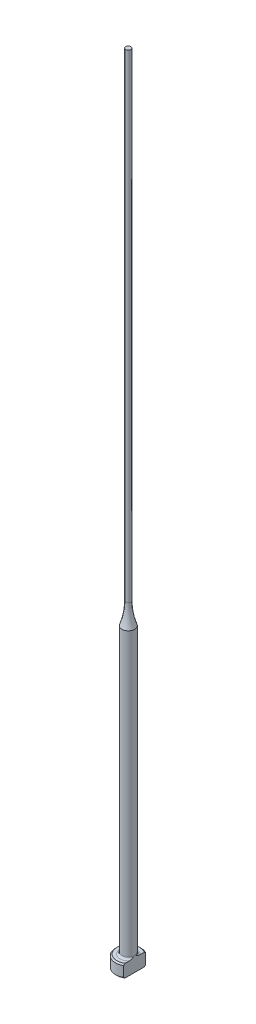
ISO-10303-21;
HEADER;
FILE_DESCRIPTION(('STEP AP214'),'2;1');
FILE_NAME('part.step','',(''),(''),'','','');
FILE_SCHEMA(('AUTOMOTIVE_DESIGN { 1 0 10303 214 1 1 1 1 }'));
ENDSEC;
DATA;
#1=APPLICATION_CONTEXT('core data for automotive mechanical design processes');
#2=APPLICATION_PROTOCOL_DEFINITION('international standard','automotive_design',2000,#1);
#3=PRODUCT_CONTEXT('',#1,'mechanical');
#4=PRODUCT('Part','Part','',(#3));
#5=PRODUCT_RELATED_PRODUCT_CATEGORY('part','',(#4));
#6=PRODUCT_DEFINITION_FORMATION('','',#4);
#7=PRODUCT_DEFINITION_CONTEXT('part definition',#1,'design');
#8=PRODUCT_DEFINITION('design','',#6,#7);
#9=PRODUCT_DEFINITION_SHAPE('','',#8);
#10=(LENGTH_UNIT() NAMED_UNIT(*) SI_UNIT(.MILLI.,.METRE.));
#11=(NAMED_UNIT(*) PLANE_ANGLE_UNIT() SI_UNIT($,.RADIAN.));
#12=(NAMED_UNIT(*) SI_UNIT($,.STERADIAN.) SOLID_ANGLE_UNIT());
#13=UNCERTAINTY_MEASURE_WITH_UNIT(LENGTH_MEASURE(1.E-05),#10,'distance_accuracy_value','');
#14=(GEOMETRIC_REPRESENTATION_CONTEXT(3) GLOBAL_UNCERTAINTY_ASSIGNED_CONTEXT((#13)) GLOBAL_UNIT_ASSIGNED_CONTEXT((#10,
#11,#12)) REPRESENTATION_CONTEXT('',''));
#15=CARTESIAN_POINT('',(0.,0.,0.));
#16=DIRECTION('',(0.,0.,1.));
#17=DIRECTION('',(1.,0.,0.));
#18=AXIS2_PLACEMENT_3D('',#15,#16,#17);
#19=CARTESIAN_POINT('',(-1.99999999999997,2.,0.));
#20=DIRECTION('',(0.,1.,0.));
#21=DIRECTION('',(0.,0.,1.));
#22=AXIS2_PLACEMENT_3D('',#19,#20,#21);
#23=PLANE('',#22);
#24=CARTESIAN_POINT('',(0.,2.,0.));
#25=DIRECTION('',(0.,1.,0.));
#26=DIRECTION('',(0.,0.,1.));
#27=AXIS2_PLACEMENT_3D('',#24,#25,#26);
#28=CIRCLE('',#27,1.79999999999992);
#29=CARTESIAN_POINT('',(0.999999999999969,2.,-1.4966629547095));
#30=VERTEX_POINT('',#29);
#31=CARTESIAN_POINT('',(0.999999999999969,2.,1.4966629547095));
#32=VERTEX_POINT('',#31);
#33=EDGE_CURVE('E187',#30,#32,#28,.T.);
#34=ORIENTED_EDGE('',*,*,#33,.T.);
#35=DIRECTION('',(0.,0.,-1.));
#36=VECTOR('',#35,1.);
#37=CARTESIAN_POINT('',(0.999999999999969,2.,0.));
#38=LINE('',#37,#36);
#39=CARTESIAN_POINT('',(0.999999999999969,2.00000000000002,0.830662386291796));
#40=VERTEX_POINT('',#39);
#41=EDGE_CURVE('E57',#32,#40,#38,.T.);
#42=ORIENTED_EDGE('',*,*,#41,.T.);
#43=CARTESIAN_POINT('',(0.,2.,0.));
#44=DIRECTION('',(0.,1.,0.));
#45=DIRECTION('',(0.,0.,1.));
#46=AXIS2_PLACEMENT_3D('',#43,#44,#45);
#47=CIRCLE('',#46,1.29999999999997);
#48=CARTESIAN_POINT('',(0.999999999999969,2.00000000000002,-0.830662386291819));
#49=VERTEX_POINT('',#48);
#50=EDGE_CURVE('E108',#40,#49,#47,.F.);
#51=ORIENTED_EDGE('',*,*,#50,.T.);
#52=EDGE_CURVE('E137',#49,#30,#38,.T.);
#53=ORIENTED_EDGE('',*,*,#52,.T.);
#54=EDGE_LOOP('',(#34,#42,#51,#53));
#55=FACE_BOUND('',#54,.T.);
#56=ADVANCED_FACE('F32',(#55),#23,.T.);
#57=CARTESIAN_POINT('',(0.,259.958771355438,0.));
#58=DIRECTION('',(0.,1.,0.));
#59=DIRECTION('',(0.,0.,1.));
#60=AXIS2_PLACEMENT_3D('',#57,#58,#59);
#61=CYLINDRICAL_SURFACE('',#60,1.99999999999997);
#62=CARTESIAN_POINT('',(0.,1.79999999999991,0.));
#63=DIRECTION('',(0.,1.,0.));
#64=DIRECTION('',(0.,0.,1.));
#65=AXIS2_PLACEMENT_3D('',#62,#63,#64);
#66=CIRCLE('',#65,1.99999999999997);
#67=CARTESIAN_POINT('',(0.999999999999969,1.79999999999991,1.73205080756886));
#68=VERTEX_POINT('',#67);
#69=CARTESIAN_POINT('',(0.999999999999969,1.79999999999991,-1.73205080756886));
#70=VERTEX_POINT('',#69);
#71=EDGE_CURVE('E105',#68,#70,#66,.F.);
#72=ORIENTED_EDGE('',*,*,#71,.T.);
#73=DIRECTION('',(0.,-1.,0.));
#74=VECTOR('',#73,1.);
#75=CARTESIAN_POINT('',(0.999999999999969,125.,-1.73205080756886));
#76=LINE('',#75,#74);
#77=CARTESIAN_POINT('',(0.999999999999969,0.199999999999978,-1.73205080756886));
#78=VERTEX_POINT('',#77);
#79=EDGE_CURVE('E193',#70,#78,#76,.T.);
#80=ORIENTED_EDGE('',*,*,#79,.T.);
#81=CARTESIAN_POINT('',(0.,0.199999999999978,0.));
#82=DIRECTION('',(0.,-1.,0.));
#83=DIRECTION('',(0.,0.,-1.));
#84=AXIS2_PLACEMENT_3D('',#81,#82,#83);
#85=CIRCLE('',#84,1.99999999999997);
#86=CARTESIAN_POINT('',(0.999999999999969,0.199999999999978,1.73205080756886));
#87=VERTEX_POINT('',#86);
#88=EDGE_CURVE('E100',#78,#87,#85,.F.);
#89=ORIENTED_EDGE('',*,*,#88,.T.);
#90=DIRECTION('',(0.,-1.,0.));
#91=VECTOR('',#90,1.);
#92=CARTESIAN_POINT('',(0.999999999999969,125.,1.73205080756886));
#93=LINE('',#92,#91);
#94=EDGE_CURVE('E93',#68,#87,#93,.T.);
#95=ORIENTED_EDGE('',*,*,#94,.F.);
#96=EDGE_LOOP('',(#72,#80,#89,#95));
#97=FACE_BOUND('',#96,.T.);
#98=ADVANCED_FACE('F158',(#97),#61,.T.);
#99=CARTESIAN_POINT('',(0.,0.,0.));
#100=DIRECTION('',(0.,-1.,0.));
#101=DIRECTION('',(0.,0.,-1.));
#102=AXIS2_PLACEMENT_3D('',#99,#100,#101);
#103=PLANE('',#102);
#104=CARTESIAN_POINT('',(0.,0.,0.));
#105=DIRECTION('',(0.,-1.,0.));
#106=DIRECTION('',(0.,0.,-1.));
#107=AXIS2_PLACEMENT_3D('',#104,#105,#106);
#108=CIRCLE('',#107,1.8);
#109=CARTESIAN_POINT('',(0.999999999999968,0.,1.49666295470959));
#110=VERTEX_POINT('',#109);
#111=CARTESIAN_POINT('',(0.999999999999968,0.,-1.49666295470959));
#112=VERTEX_POINT('',#111);
#113=EDGE_CURVE('E98',#110,#112,#108,.T.);
#114=ORIENTED_EDGE('',*,*,#113,.T.);
#115=DIRECTION('',(0.,0.,1.));
#116=VECTOR('',#115,1.);
#117=CARTESIAN_POINT('',(0.999999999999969,0.,-1.73205080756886));
#118=LINE('',#117,#116);
#119=EDGE_CURVE('E83',#112,#110,#118,.T.);
#120=ORIENTED_EDGE('',*,*,#119,.T.);
#121=EDGE_LOOP('',(#114,#120));
#122=FACE_BOUND('',#121,.T.);
#123=ADVANCED_FACE('F103',(#122),#103,.T.);
#124=CARTESIAN_POINT('',(0.,2.,0.));
#125=DIRECTION('',(0.,-1.,0.));
#126=DIRECTION('',(0.,0.,-1.));
#127=AXIS2_PLACEMENT_3D('',#124,#125,#126);
#128=CONICAL_SURFACE('',#127,1.79999999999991,0.785398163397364);
#129=ORIENTED_EDGE('',*,*,#71,.F.);
#130=CARTESIAN_POINT('',(0.999999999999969,-0.143084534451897,3.81417299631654));
#131=CARTESIAN_POINT('',(0.999999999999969,-0.0593997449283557,3.72765647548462));
#132=CARTESIAN_POINT('',(0.999999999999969,0.0241940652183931,3.64105173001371));
#133=CARTESIAN_POINT('',(0.999999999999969,0.19114891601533,3.46761616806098));
#134=CARTESIAN_POINT('',(0.999999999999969,0.27450995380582,3.38078534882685));
#135=CARTESIAN_POINT('',(0.999999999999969,0.52424932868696,3.11979400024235));
#136=CARTESIAN_POINT('',(0.999999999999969,0.690198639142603,2.94522254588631));
#137=CARTESIAN_POINT('',(0.999999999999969,1.0169755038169,2.59782670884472));
#138=CARTESIAN_POINT('',(0.999999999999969,1.1778392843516,2.42503661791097));
#139=CARTESIAN_POINT('',(0.999999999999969,1.41669118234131,2.16364984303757));
#140=CARTESIAN_POINT('',(0.999999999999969,1.49589273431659,2.07616357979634));
#141=CARTESIAN_POINT('',(0.999999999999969,1.653138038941,1.90015721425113));
#142=CARTESIAN_POINT('',(0.999999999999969,1.73118183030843,1.81163714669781));
#143=CARTESIAN_POINT('',(0.999999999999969,1.85567318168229,1.66767927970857));
#144=CARTESIAN_POINT('',(0.999999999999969,1.90265415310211,1.61270332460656));
#145=CARTESIAN_POINT('',(0.999999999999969,1.99577882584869,1.50203557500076));
#146=CARTESIAN_POINT('',(0.999999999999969,2.04192244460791,1.44634371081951));
#147=CARTESIAN_POINT('',(0.999999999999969,2.13356596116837,1.33345480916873));
#148=CARTESIAN_POINT('',(0.999999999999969,2.17905399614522,1.27624810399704));
#149=CARTESIAN_POINT('',(0.999999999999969,2.26844283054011,1.1606097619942));
#150=CARTESIAN_POINT('',(0.999999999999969,2.31234379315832,1.1021782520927));
#151=CARTESIAN_POINT('',(0.999999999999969,2.39853453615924,0.982773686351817));
#152=CARTESIAN_POINT('',(0.999999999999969,2.44078986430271,0.92177554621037));
#153=CARTESIAN_POINT('',(0.999999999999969,2.5218781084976,0.79738711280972));
#154=CARTESIAN_POINT('',(0.999999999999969,2.56070631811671,0.733993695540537));
#155=CARTESIAN_POINT('',(0.999999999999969,2.63248592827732,0.604932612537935));
#156=CARTESIAN_POINT('',(0.999999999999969,2.66550424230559,0.539302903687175));
#157=CARTESIAN_POINT('',(0.999999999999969,2.72301550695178,0.404437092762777));
#158=CARTESIAN_POINT('',(0.999999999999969,2.74753707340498,0.335214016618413));
#159=CARTESIAN_POINT('',(0.999999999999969,2.77407110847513,0.231400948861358));
#160=CARTESIAN_POINT('',(0.999999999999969,2.78110742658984,0.198093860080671));
#161=CARTESIAN_POINT('',(0.999999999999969,2.79200506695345,0.130954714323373));
#162=CARTESIAN_POINT('',(0.999999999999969,2.79586666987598,0.0971227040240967));
#163=CARTESIAN_POINT('',(0.999999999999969,2.80013905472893,0.0293410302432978));
#164=CARTESIAN_POINT('',(0.999999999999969,2.80056046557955,-0.00460794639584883));
#165=CARTESIAN_POINT('',(0.999999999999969,2.79795882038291,-0.0723663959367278));
#166=CARTESIAN_POINT('',(0.999999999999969,2.79493547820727,-0.106175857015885));
#167=CARTESIAN_POINT('',(0.999999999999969,2.78105481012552,-0.206326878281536));
#168=CARTESIAN_POINT('',(0.999999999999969,2.76542146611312,-0.272037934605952));
#169=CARTESIAN_POINT('',(0.999999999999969,2.73477554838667,-0.368312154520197));
#170=CARTESIAN_POINT('',(0.999999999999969,2.72331063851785,-0.400123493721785));
#171=CARTESIAN_POINT('',(0.999999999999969,2.69840546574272,-0.462964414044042));
#172=CARTESIAN_POINT('',(0.999999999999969,2.68496560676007,-0.493994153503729));
#173=CARTESIAN_POINT('',(0.999999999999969,2.64209309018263,-0.586298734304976));
#174=CARTESIAN_POINT('',(0.999999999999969,2.61022871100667,-0.64643570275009));
#175=CARTESIAN_POINT('',(0.999999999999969,2.54228534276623,-0.76430433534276));
#176=CARTESIAN_POINT('',(0.999999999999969,2.50620119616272,-0.822032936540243));
#177=CARTESIAN_POINT('',(0.999999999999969,2.43107084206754,-0.935840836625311));
#178=CARTESIAN_POINT('',(0.999999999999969,2.39201347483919,-0.991912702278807));
#179=CARTESIAN_POINT('',(0.999999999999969,2.31195870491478,-1.10259849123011));
#180=CARTESIAN_POINT('',(0.999999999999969,2.27096226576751,-1.15721311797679));
#181=CARTESIAN_POINT('',(0.999999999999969,2.18701695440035,-1.26606869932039));
#182=CARTESIAN_POINT('',(0.999999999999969,2.14404946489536,-1.32029522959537));
#183=CARTESIAN_POINT('',(0.999999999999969,2.05705050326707,-1.42788988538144));
#184=CARTESIAN_POINT('',(0.999999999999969,2.01301896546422,-1.48125795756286));
#185=CARTESIAN_POINT('',(0.999999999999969,1.8799506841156,-1.64010952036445));
#186=CARTESIAN_POINT('',(0.999999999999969,1.78973357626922,-1.74460261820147));
#187=CARTESIAN_POINT('',(0.999999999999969,1.62290341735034,-1.9342683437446));
#188=CARTESIAN_POINT('',(0.999999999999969,1.54658658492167,-2.01970404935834));
#189=CARTESIAN_POINT('',(0.999999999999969,1.39301250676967,-2.18973019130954));
#190=CARTESIAN_POINT('',(0.999999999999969,1.31575523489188,-2.27432060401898));
#191=CARTESIAN_POINT('',(0.999999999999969,1.08283440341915,-2.52732479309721));
#192=CARTESIAN_POINT('',(0.999999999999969,0.926165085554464,-2.69481086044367));
#193=CARTESIAN_POINT('',(0.999999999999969,0.617772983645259,-3.0214725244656));
#194=CARTESIAN_POINT('',(0.999999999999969,0.466111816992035,-3.18070657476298));
#195=CARTESIAN_POINT('',(0.999999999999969,0.238015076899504,-3.41880818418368));
#196=CARTESIAN_POINT('',(0.999999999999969,0.161924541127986,-3.49800657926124));
#197=CARTESIAN_POINT('',(0.999999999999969,0.00955322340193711,-3.65621892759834));
#198=CARTESIAN_POINT('',(0.999999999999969,-0.0667275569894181,-3.73523288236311));
#199=CARTESIAN_POINT('',(0.999999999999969,-0.143084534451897,-3.81417299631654));
#200=B_SPLINE_CURVE_WITH_KNOTS('',3,(#130,#131,#132,#133,#134,#135,#136,#137,#138,#139,#140,
#141,#142,#143,#144,#145,#146,#147,#148,#149,#150,#151,#152,#153,#154,#155,#156,#157,#158,#159,
#160,#161,#162,#163,#164,#165,#166,#167,#168,#169,#170,#171,#172,#173,#174,#175,#176,#177,#178,
#179,#180,#181,#182,#183,#184,#185,#186,#187,#188,#189,#190,#191,#192,#193,#194,#195,#196,#197,
#198,#199),.UNSPECIFIED.,.F.,.F.,(4,2,2,2,2,2,2,2,2,2,2,2,2,2,2,2,2,2,2,2,2,2,2,2,2,2,2,2,2,2,2,
2,2,2,4),(0.,0.361101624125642,0.722207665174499,1.44478731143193,2.15299784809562,
2.50702638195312,2.86104304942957,3.07798416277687,3.29494655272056,3.51418925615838,
3.73340935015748,3.95594813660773,4.17878792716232,4.3988639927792,4.6181915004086,
4.72018864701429,4.82217677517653,4.92384967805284,5.02553102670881,5.22698459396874,
5.32838854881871,5.4297717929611,5.63365200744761,5.83778406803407,6.04272417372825,
6.24756349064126,6.4551039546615,6.66265726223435,7.07676259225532,7.42043039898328,
7.76410778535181,8.45210822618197,9.11180822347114,9.44129145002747,9.77077197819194),.UNSPECIFIED.);
#201=EDGE_CURVE('E136',#68,#32,#200,.T.);
#202=ORIENTED_EDGE('',*,*,#201,.T.);
#203=ORIENTED_EDGE('',*,*,#33,.F.);
#204=EDGE_CURVE('E128',#30,#70,#200,.T.);
#205=ORIENTED_EDGE('',*,*,#204,.T.);
#206=EDGE_LOOP('',(#129,#202,#203,#205));
#207=FACE_BOUND('',#206,.T.);
#208=ADVANCED_FACE('F144',(#207),#128,.T.);
#209=CARTESIAN_POINT('',(0.,0.199999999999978,0.));
#210=DIRECTION('',(0.,1.,0.));
#211=DIRECTION('',(0.,0.,1.));
#212=AXIS2_PLACEMENT_3D('',#209,#210,#211);
#213=CONICAL_SURFACE('',#212,1.99999999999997,0.785398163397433);
#214=ORIENTED_EDGE('',*,*,#88,.F.);
#215=CARTESIAN_POINT('',(0.999999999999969,2.14308453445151,-3.81417299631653));
#216=CARTESIAN_POINT('',(0.999999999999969,2.05939974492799,-3.72765647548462));
#217=CARTESIAN_POINT('',(0.999999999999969,1.97580593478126,-3.64105173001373));
#218=CARTESIAN_POINT('',(0.999999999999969,1.80885108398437,-3.46761616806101));
#219=CARTESIAN_POINT('',(0.999999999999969,1.7254900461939,-3.38078534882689));
#220=CARTESIAN_POINT('',(0.999999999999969,1.47575067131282,-3.11979400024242));
#221=CARTESIAN_POINT('',(0.999999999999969,1.30980136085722,-2.94522254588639));
#222=CARTESIAN_POINT('',(0.999999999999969,0.983024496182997,-2.59782670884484));
#223=CARTESIAN_POINT('',(0.999999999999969,0.822160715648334,-2.42503661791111));
#224=CARTESIAN_POINT('',(0.999999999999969,0.583308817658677,-2.16364984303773));
#225=CARTESIAN_POINT('',(0.999999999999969,0.504107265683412,-2.07616357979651));
#226=CARTESIAN_POINT('',(0.999999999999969,0.34686196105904,-1.90015721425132));
#227=CARTESIAN_POINT('',(0.999999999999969,0.268818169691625,-1.81163714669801));
#228=CARTESIAN_POINT('',(0.999999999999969,0.144326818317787,-1.66767927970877));
#229=CARTESIAN_POINT('',(0.999999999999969,0.097345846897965,-1.61270332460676));
#230=CARTESIAN_POINT('',(0.999999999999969,0.00422117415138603,-1.50203557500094));
#231=CARTESIAN_POINT('',(0.999999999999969,-0.0419224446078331,-1.44634371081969));
#232=CARTESIAN_POINT('',(0.999999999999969,-0.133565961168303,-1.33345480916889));
#233=CARTESIAN_POINT('',(0.999999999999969,-0.179053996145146,-1.2762481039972));
#234=CARTESIAN_POINT('',(0.999999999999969,-0.268442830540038,-1.16060976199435));
#235=CARTESIAN_POINT('',(0.999999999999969,-0.312343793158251,-1.10217825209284));
#236=CARTESIAN_POINT('',(0.999999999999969,-0.398534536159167,-0.982773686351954));
#237=CARTESIAN_POINT('',(0.999999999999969,-0.440789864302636,-0.921775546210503));
#238=CARTESIAN_POINT('',(0.999999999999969,-0.521878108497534,-0.797387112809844));
#239=CARTESIAN_POINT('',(0.999999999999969,-0.560706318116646,-0.733993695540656));
#240=CARTESIAN_POINT('',(0.999999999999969,-0.632485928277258,-0.604932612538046));
#241=CARTESIAN_POINT('',(0.999999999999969,-0.665504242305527,-0.539302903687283));
#242=CARTESIAN_POINT('',(0.999999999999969,-0.723015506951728,-0.404437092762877));
#243=CARTESIAN_POINT('',(0.999999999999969,-0.747537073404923,-0.335214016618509));
#244=CARTESIAN_POINT('',(0.999999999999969,-0.774071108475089,-0.231400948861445));
#245=CARTESIAN_POINT('',(0.999999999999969,-0.781107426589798,-0.198093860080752));
#246=CARTESIAN_POINT('',(0.999999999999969,-0.792005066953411,-0.130954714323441));
#247=CARTESIAN_POINT('',(0.999999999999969,-0.795866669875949,-0.097122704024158));
#248=CARTESIAN_POINT('',(0.999999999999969,-0.800139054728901,-0.0293410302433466));
#249=CARTESIAN_POINT('',(0.999999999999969,-0.800560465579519,0.00460794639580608));
#250=CARTESIAN_POINT('',(0.999999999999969,-0.797958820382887,0.0723663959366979));
#251=CARTESIAN_POINT('',(0.999999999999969,-0.794935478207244,0.106175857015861));
#252=CARTESIAN_POINT('',(0.999999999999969,-0.78105481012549,0.206326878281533));
#253=CARTESIAN_POINT('',(0.999999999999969,-0.765421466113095,0.272037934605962));
#254=CARTESIAN_POINT('',(0.999999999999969,-0.734775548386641,0.368312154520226));
#255=CARTESIAN_POINT('',(0.999999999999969,-0.723310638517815,0.40012349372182));
#256=CARTESIAN_POINT('',(0.999999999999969,-0.698405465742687,0.46296441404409));
#257=CARTESIAN_POINT('',(0.999999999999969,-0.684965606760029,0.493994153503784));
#258=CARTESIAN_POINT('',(0.999999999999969,-0.642093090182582,0.586298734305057));
#259=CARTESIAN_POINT('',(0.999999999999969,-0.610228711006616,0.64643570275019));
#260=CARTESIAN_POINT('',(0.999999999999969,-0.542285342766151,0.764304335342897));
#261=CARTESIAN_POINT('',(0.999999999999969,-0.506201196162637,0.822032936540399));
#262=CARTESIAN_POINT('',(0.999999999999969,-0.431070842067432,0.935840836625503));
#263=CARTESIAN_POINT('',(0.999999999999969,-0.392013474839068,0.991912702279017));
#264=CARTESIAN_POINT('',(0.999999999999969,-0.311958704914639,1.10259849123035));
#265=CARTESIAN_POINT('',(0.999999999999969,-0.27096226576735,1.15721311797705));
#266=CARTESIAN_POINT('',(0.999999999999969,-0.187016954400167,1.26606869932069));
#267=CARTESIAN_POINT('',(0.999999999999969,-0.144049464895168,1.32029522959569));
#268=CARTESIAN_POINT('',(0.999999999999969,-0.0570505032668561,1.4278898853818));
#269=CARTESIAN_POINT('',(0.999999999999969,-0.0130189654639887,1.48125795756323));
#270=CARTESIAN_POINT('',(0.999999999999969,0.120049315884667,1.64010952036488));
#271=CARTESIAN_POINT('',(0.999999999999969,0.21026642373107,1.74460261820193));
#272=CARTESIAN_POINT('',(0.999999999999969,0.377096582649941,1.93426834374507));
#273=CARTESIAN_POINT('',(0.999999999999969,0.453413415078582,2.01970404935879));
#274=CARTESIAN_POINT('',(0.999999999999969,0.606987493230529,2.18973019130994));
#275=CARTESIAN_POINT('',(0.999999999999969,0.684244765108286,2.27432060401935));
#276=CARTESIAN_POINT('',(0.999999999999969,0.917165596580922,2.52732479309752));
#277=CARTESIAN_POINT('',(0.999999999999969,1.07383491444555,2.69481086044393));
#278=CARTESIAN_POINT('',(0.999999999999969,1.38222701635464,3.02147252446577));
#279=CARTESIAN_POINT('',(0.999999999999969,1.53388818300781,3.18070657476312));
#280=CARTESIAN_POINT('',(0.999999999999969,1.76198492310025,3.41880818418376));
#281=CARTESIAN_POINT('',(0.999999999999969,1.83807545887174,3.49800657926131));
#282=CARTESIAN_POINT('',(0.999999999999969,1.99044677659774,3.65621892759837));
#283=CARTESIAN_POINT('',(0.999999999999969,2.06672755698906,3.73523288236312));
#284=CARTESIAN_POINT('',(0.999999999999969,2.14308453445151,3.81417299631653));
#285=B_SPLINE_CURVE_WITH_KNOTS('',3,(#215,#216,#217,#218,#219,#220,#221,#222,#223,#224,#225,
#226,#227,#228,#229,#230,#231,#232,#233,#234,#235,#236,#237,#238,#239,#240,#241,#242,#243,#244,
#245,#246,#247,#248,#249,#250,#251,#252,#253,#254,#255,#256,#257,#258,#259,#260,#261,#262,#263,
#264,#265,#266,#267,#268,#269,#270,#271,#272,#273,#274,#275,#276,#277,#278,#279,#280,#281,#282,
#283,#284),.UNSPECIFIED.,.F.,.F.,(4,2,2,2,2,2,2,2,2,2,2,2,2,2,2,2,2,2,2,2,2,2,2,2,2,2,2,2,2,2,2,
2,2,2,4),(0.,0.36110162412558,0.722207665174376,1.44478731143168,2.15299784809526,
2.5070263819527,2.8610430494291,3.07798416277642,3.29494655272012,3.51418925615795,
3.73340935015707,3.95594813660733,4.17878792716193,4.39886399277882,4.61819150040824,
4.72018864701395,4.82217677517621,4.92384967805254,5.02553102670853,5.22698459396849,
5.32838854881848,5.42977179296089,5.63365200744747,5.83778406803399,6.04272417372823,
6.24756349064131,6.45510395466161,6.66265726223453,7.07676259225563,7.42043039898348,
7.7641077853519,8.45210822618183,9.1118082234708,9.44129145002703,9.77077197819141),.UNSPECIFIED.);
#286=EDGE_CURVE('E86',#78,#112,#285,.T.);
#287=ORIENTED_EDGE('',*,*,#286,.T.);
#288=ORIENTED_EDGE('',*,*,#113,.F.);
#289=EDGE_CURVE('E89',#110,#87,#285,.T.);
#290=ORIENTED_EDGE('',*,*,#289,.T.);
#291=EDGE_LOOP('',(#214,#287,#288,#290));
#292=FACE_BOUND('',#291,.T.);
#293=ADVANCED_FACE('F97',(#292),#213,.T.);
#294=CARTESIAN_POINT('',(0.,2.30000000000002,0.));
#295=DIRECTION('',(0.,1.,0.));
#296=DIRECTION('',(0.,0.,1.));
#297=AXIS2_PLACEMENT_3D('',#294,#295,#296);
#298=TOROIDAL_SURFACE('',#297,1.29999999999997,0.3);
#299=CARTESIAN_POINT('',(0.999999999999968,2.30000000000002,0.));
#300=CARTESIAN_POINT('',(0.999999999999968,2.30000064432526,8.6574445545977E-12));
#301=CARTESIAN_POINT('',(0.999999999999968,2.30000128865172,-9.05742231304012E-08));
#302=CARTESIAN_POINT('',(0.999999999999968,2.30000254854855,-3.98319620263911E-07));
#303=CARTESIAN_POINT('',(0.999999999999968,2.30000316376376,-6.16748313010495E-07));
#304=CARTESIAN_POINT('',(0.999999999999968,2.30000438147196,-1.15047367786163E-06));
#305=CARTESIAN_POINT('',(0.999999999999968,2.30000498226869,-1.46954564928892E-06));
#306=CARTESIAN_POINT('',(0.999999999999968,2.30000613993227,-2.17388585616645E-06));
#307=CARTESIAN_POINT('',(0.999999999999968,2.3000066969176,-2.55896592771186E-06));
#308=CARTESIAN_POINT('',(0.999999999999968,2.30000847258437,-3.89137454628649E-06));
#309=CARTESIAN_POINT('',(0.999999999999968,2.30000962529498,-4.9272569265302E-06));
#310=CARTESIAN_POINT('',(0.999999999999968,2.30001175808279,-7.12255376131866E-06));
#311=CARTESIAN_POINT('',(0.999999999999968,2.30001274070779,-8.27963246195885E-06));
#312=CARTESIAN_POINT('',(0.999999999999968,2.30001619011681,-1.25710396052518E-05));
#313=CARTESIAN_POINT('',(0.999999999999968,2.30001847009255,-1.58589994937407E-05));
#314=CARTESIAN_POINT('',(0.999999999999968,2.3000224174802,-2.25210462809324E-05));
#315=CARTESIAN_POINT('',(0.999999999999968,2.30002411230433,-2.58796667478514E-05));
#316=CARTESIAN_POINT('',(0.999999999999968,2.30003085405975,-3.94941957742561E-05));
#317=CARTESIAN_POINT('',(0.999999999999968,2.30003568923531,-4.98493079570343E-05));
#318=CARTESIAN_POINT('',(0.999999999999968,2.30004388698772,-6.96407730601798E-05));
#319=CARTESIAN_POINT('',(0.999999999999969,2.30004735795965,-7.903098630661E-05));
#320=CARTESIAN_POINT('',(0.999999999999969,2.30007348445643,-0.000144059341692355));
#321=CARTESIAN_POINT('',(0.999999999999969,2.30010510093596,-0.000195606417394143));
#322=CARTESIAN_POINT('',(0.999999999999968,2.30022061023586,-0.000391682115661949));
#323=CARTESIAN_POINT('',(0.999999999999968,2.3002978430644,-0.000539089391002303));
#324=CARTESIAN_POINT('',(0.999999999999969,2.30059433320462,-0.00109591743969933));
#325=CARTESIAN_POINT('',(0.999999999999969,2.30082052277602,-0.00150237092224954));
#326=CARTESIAN_POINT('',(0.999999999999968,2.30171558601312,-0.00311941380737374));
#327=CARTESIAN_POINT('',(0.999999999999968,2.30237677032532,-0.00433326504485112));
#328=CARTESIAN_POINT('',(0.999999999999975,2.31602135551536,-0.0293725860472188));
#329=CARTESIAN_POINT('',(0.99999999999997,2.32909104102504,-0.0531623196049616));
#330=CARTESIAN_POINT('',(0.999999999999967,2.35458080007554,-0.100088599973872));
#331=CARTESIAN_POINT('',(0.999999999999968,2.36700820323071,-0.123221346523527));
#332=CARTESIAN_POINT('',(0.999999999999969,2.39281545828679,-0.172044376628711));
#333=CARTESIAN_POINT('',(0.999999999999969,2.4061616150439,-0.197752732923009));
#334=CARTESIAN_POINT('',(0.999999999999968,2.4323541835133,-0.249714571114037));
#335=CARTESIAN_POINT('',(0.999999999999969,2.44519503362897,-0.27597087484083));
#336=CARTESIAN_POINT('',(0.999999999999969,2.46718175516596,-0.322864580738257));
#337=CARTESIAN_POINT('',(0.999999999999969,2.47650292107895,-0.34341923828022));
#338=CARTESIAN_POINT('',(0.999999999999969,2.49448113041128,-0.384761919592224));
#339=CARTESIAN_POINT('',(0.999999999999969,2.50313958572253,-0.405549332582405));
#340=CARTESIAN_POINT('',(0.999999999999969,2.5276434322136,-0.467585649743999));
#341=CARTESIAN_POINT('',(0.999999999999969,2.54239224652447,-0.509286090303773));
#342=CARTESIAN_POINT('',(0.999999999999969,2.56458900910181,-0.58349816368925));
#343=CARTESIAN_POINT('',(0.999999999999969,2.57294045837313,-0.61573699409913));
#344=CARTESIAN_POINT('',(0.999999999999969,2.58691787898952,-0.682155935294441));
#345=CARTESIAN_POINT('',(0.999999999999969,2.5924232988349,-0.716362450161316));
#346=CARTESIAN_POINT('',(0.999999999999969,2.59932200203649,-0.784996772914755));
#347=CARTESIAN_POINT('',(0.999999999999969,2.60074119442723,-0.819421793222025));
#348=CARTESIAN_POINT('',(0.999999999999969,2.59853032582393,-0.88779225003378));
#349=CARTESIAN_POINT('',(0.999999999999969,2.59495737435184,-0.921738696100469));
#350=CARTESIAN_POINT('',(0.999999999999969,2.58381038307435,-0.977927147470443));
#351=CARTESIAN_POINT('',(0.999999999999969,2.57785171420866,-1.00048693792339));
#352=CARTESIAN_POINT('',(0.999999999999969,2.56267132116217,-1.0445512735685));
#353=CARTESIAN_POINT('',(0.999999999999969,2.55344592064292,-1.06605459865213));
#354=CARTESIAN_POINT('',(0.999999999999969,2.53348156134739,-1.10327564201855));
#355=CARTESIAN_POINT('',(0.999999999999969,2.52335553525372,-1.11931996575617));
#356=CARTESIAN_POINT('',(0.999999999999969,2.50063930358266,-1.1495565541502));
#357=CARTESIAN_POINT('',(0.999999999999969,2.48805327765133,-1.16375189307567));
#358=CARTESIAN_POINT('',(0.999999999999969,2.46313284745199,-1.18709127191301));
#359=CARTESIAN_POINT('',(0.999999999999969,2.45121755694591,-1.19668155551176));
#360=CARTESIAN_POINT('',(0.999999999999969,2.4259612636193,-1.21377371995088));
#361=CARTESIAN_POINT('',(0.999999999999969,2.41262072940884,-1.2212762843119));
#362=CARTESIAN_POINT('',(0.999999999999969,2.38471163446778,-1.23381879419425));
#363=CARTESIAN_POINT('',(0.999999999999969,2.3701356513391,-1.23884240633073));
#364=CARTESIAN_POINT('',(0.999999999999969,2.34029120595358,-1.2460136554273));
#365=CARTESIAN_POINT('',(0.999999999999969,2.32502317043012,-1.24816304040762));
#366=CARTESIAN_POINT('',(0.999999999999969,2.29609418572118,-1.24936303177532));
#367=CARTESIAN_POINT('',(0.999999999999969,2.28244572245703,-1.24873511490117));
#368=CARTESIAN_POINT('',(0.999999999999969,2.25546467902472,-1.24513625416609));
#369=CARTESIAN_POINT('',(0.999999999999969,2.2421320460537,-1.24216570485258));
#370=CARTESIAN_POINT('',(0.999999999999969,2.21644742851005,-1.23414136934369));
#371=CARTESIAN_POINT('',(0.999999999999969,2.20408009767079,-1.22913614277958));
#372=CARTESIAN_POINT('',(0.999999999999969,2.18026539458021,-1.2172891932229));
#373=CARTESIAN_POINT('',(0.999999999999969,2.16881815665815,-1.21044720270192));
#374=CARTESIAN_POINT('',(0.999999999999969,2.14602713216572,-1.19450929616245));
#375=CARTESIAN_POINT('',(0.999999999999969,2.1347876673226,-1.18526487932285));
#376=CARTESIAN_POINT('',(0.999999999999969,2.11372805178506,-1.16528066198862));
#377=CARTESIAN_POINT('',(0.999999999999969,2.1039092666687,-1.15453944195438));
#378=CARTESIAN_POINT('',(0.999999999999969,2.08131380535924,-1.12639326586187));
#379=CARTESIAN_POINT('',(0.999999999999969,2.06941227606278,-1.10828305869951));
#380=CARTESIAN_POINT('',(0.999999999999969,2.04871157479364,-1.07041295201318));
#381=CARTESIAN_POINT('',(0.999999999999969,2.03991325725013,-1.05065259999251));
#382=CARTESIAN_POINT('',(0.999999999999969,2.02219264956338,-1.00203188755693));
#383=CARTESIAN_POINT('',(0.999999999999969,2.01461756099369,-0.972682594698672));
#384=CARTESIAN_POINT('',(0.999999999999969,2.00410660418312,-0.912914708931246));
#385=CARTESIAN_POINT('',(0.999999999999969,2.00122174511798,-0.882487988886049));
#386=CARTESIAN_POINT('',(0.999999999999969,1.99886242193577,-0.80318909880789));
#387=CARTESIAN_POINT('',(0.999999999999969,2.0024814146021,-0.754226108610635));
#388=CARTESIAN_POINT('',(0.999999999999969,2.01327071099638,-0.682724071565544));
#389=CARTESIAN_POINT('',(0.999999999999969,2.01762186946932,-0.659663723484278));
#390=CARTESIAN_POINT('',(0.999999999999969,2.02775671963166,-0.613959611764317));
#391=CARTESIAN_POINT('',(0.999999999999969,2.03353398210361,-0.59131445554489));
#392=CARTESIAN_POINT('',(0.999999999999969,2.05232003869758,-0.525222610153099));
#393=CARTESIAN_POINT('',(0.999999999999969,2.0670175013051,-0.482256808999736));
#394=CARTESIAN_POINT('',(0.999999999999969,2.09166172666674,-0.418361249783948));
#395=CARTESIAN_POINT('',(0.999999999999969,2.10040936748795,-0.396945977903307));
#396=CARTESIAN_POINT('',(0.999999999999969,2.11862724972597,-0.354367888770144));
#397=CARTESIAN_POINT('',(0.999999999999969,2.12809902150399,-0.33320572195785));
#398=CARTESIAN_POINT('',(0.999999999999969,2.15054796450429,-0.284809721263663));
#399=CARTESIAN_POINT('',(0.999999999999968,2.16372144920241,-0.257667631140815));
#400=CARTESIAN_POINT('',(0.999999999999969,2.19063957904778,-0.203972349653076));
#401=CARTESIAN_POINT('',(0.999999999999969,2.20437810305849,-0.177416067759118));
#402=CARTESIAN_POINT('',(0.999999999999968,2.23096755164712,-0.127000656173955));
#403=CARTESIAN_POINT('',(0.999999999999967,2.2437812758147,-0.103121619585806));
#404=CARTESIAN_POINT('',(0.99999999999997,2.27007504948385,-0.0546869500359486));
#405=CARTESIAN_POINT('',(0.999999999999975,2.28356304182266,-0.0301354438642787));
#406=CARTESIAN_POINT('',(0.999999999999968,2.29762327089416,-0.00433318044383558));
#407=CARTESIAN_POINT('',(0.999999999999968,2.29828450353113,-0.00311924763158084));
#408=CARTESIAN_POINT('',(0.999999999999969,2.29917957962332,-0.0015021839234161));
#409=CARTESIAN_POINT('',(0.999999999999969,2.2994057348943,-0.0010957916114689));
#410=CARTESIAN_POINT('',(0.999999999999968,2.29970218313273,-0.000539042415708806));
#411=CARTESIAN_POINT('',(0.999999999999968,2.29977940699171,-0.000391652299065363));
#412=CARTESIAN_POINT('',(0.999999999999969,2.29989490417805,-0.000195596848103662));
#413=CARTESIAN_POINT('',(0.999999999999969,2.2999265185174,-0.000144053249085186));
#414=CARTESIAN_POINT('',(0.999999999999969,2.29995264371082,-7.90290824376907E-05));
#415=CARTESIAN_POINT('',(0.999999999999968,2.29995611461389,-6.96391975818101E-05));
#416=CARTESIAN_POINT('',(0.999999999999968,2.29996431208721,-4.98484228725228E-05));
#417=CARTESIAN_POINT('',(0.999999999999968,2.29996914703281,-3.94936645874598E-05));
#418=CARTESIAN_POINT('',(0.999999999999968,2.29997588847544,-2.587953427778E-05));
#419=CARTESIAN_POINT('',(0.999999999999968,2.29997758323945,-2.25209724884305E-05));
#420=CARTESIAN_POINT('',(0.999999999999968,2.29998153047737,-1.58590310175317E-05));
#421=CARTESIAN_POINT('',(0.999999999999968,2.29998381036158,-1.25711163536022E-05));
#422=CARTESIAN_POINT('',(0.999999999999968,2.29998725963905,-8.27974911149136E-06));
#423=CARTESIAN_POINT('',(0.999999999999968,2.29998824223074,-7.122675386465E-06));
#424=CARTESIAN_POINT('',(0.999999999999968,2.29999037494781,-4.92738159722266E-06));
#425=CARTESIAN_POINT('',(0.999999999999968,2.29999152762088,-3.89149712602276E-06));
#426=CARTESIAN_POINT('',(0.999999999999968,2.29999330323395,-2.5590774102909E-06));
#427=CARTESIAN_POINT('',(0.999999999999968,2.29999386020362,-2.17399250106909E-06));
#428=CARTESIAN_POINT('',(0.999999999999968,2.29999501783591,-1.4696398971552E-06));
#429=CARTESIAN_POINT('',(0.999999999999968,2.299995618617,-1.15056035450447E-06));
#430=CARTESIAN_POINT('',(0.999999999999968,2.29999683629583,-6.16816558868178E-07));
#431=CARTESIAN_POINT('',(0.999999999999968,2.29999745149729,-3.98377208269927E-07));
#432=CARTESIAN_POINT('',(0.999999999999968,2.29999871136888,-9.06063088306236E-08));
#433=CARTESIAN_POINT('',(0.999999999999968,2.29999935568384,-8.657323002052E-12));
#434=CARTESIAN_POINT('',(0.999999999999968,2.30000000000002,0.));
#435=B_SPLINE_CURVE_WITH_KNOTS('',3,(#299,#300,#301,#302,#303,#304,#305,#306,#307,#308,#309,
#310,#311,#312,#313,#314,#315,#316,#317,#318,#319,#320,#321,#322,#323,#324,#325,#326,#327,#328,
#329,#330,#331,#332,#333,#334,#335,#336,#337,#338,#339,#340,#341,#342,#343,#344,#345,#346,#347,
#348,#349,#350,#351,#352,#353,#354,#355,#356,#357,#358,#359,#360,#361,#362,#363,#364,#365,#366,
#367,#368,#369,#370,#371,#372,#373,#374,#375,#376,#377,#378,#379,#380,#381,#382,#383,#384,#385,
#386,#387,#388,#389,#390,#391,#392,#393,#394,#395,#396,#397,#398,#399,#400,#401,#402,#403,#404,
#405,#406,#407,#408,#409,#410,#411,#412,#413,#414,#415,#416,#417,#418,#419,#420,#421,#422,#423,
#424,#425,#426,#427,#428,#429,#430,#431,#432,#433,#434),.UNSPECIFIED.,.T.,.F.,(4,2,2,2,2,2,2,2,
2,2,2,2,2,2,2,2,2,2,2,2,2,2,2,2,2,2,2,2,2,2,2,2,2,2,2,2,2,2,2,2,2,2,2,2,2,2,2,2,2,2,2,2,2,2,2,2,
2,2,2,2,2,2,2,2,2,2,2,4),(0.,1.93088000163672E-06,3.88121487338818E-06,5.91576027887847E-06,
7.94459959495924E-06,1.25713540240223E-05,1.71213138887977E-05,2.9075120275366E-05,
4.0350817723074E-05,7.46190414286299E-05,0.000104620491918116,0.00028499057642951,
0.000785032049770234,0.00217951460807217,0.00632720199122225,0.0877445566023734,
0.166524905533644,0.253417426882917,0.341089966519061,0.408787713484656,0.476336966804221,
0.608850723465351,0.708652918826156,0.812393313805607,0.915474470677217,1.01738599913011,
1.08718721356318,1.15706723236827,1.21377727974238,1.27039179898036,1.31609373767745,
1.36178069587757,1.40776478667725,1.4537208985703,1.49450576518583,1.5352837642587,
1.57514089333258,1.61500383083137,1.65849635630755,1.70203041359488,1.76667915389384,
1.83134568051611,1.92177629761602,2.0131839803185,2.15955153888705,2.22993031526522,
2.29999742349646,2.43600819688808,2.50540041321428,2.57494356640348,2.66544006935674,
2.75513178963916,2.83643278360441,2.92045687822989,2.92460484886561,2.92599912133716,
2.926499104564,2.92667946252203,2.92670946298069,2.92674372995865,2.92675500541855,
2.92676695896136,2.92677150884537,2.92677613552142,2.92677816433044,2.92678019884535,
2.92678214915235,2.92678408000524),.UNSPECIFIED.);
#436=CARTESIAN_POINT('',(0.999999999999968,2.30000000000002,0.));
#437=VERTEX_POINT('',#436);
#438=EDGE_CURVE('E11',#49,#437,#435,.T.);
#439=ORIENTED_EDGE('',*,*,#438,.F.);
#440=ORIENTED_EDGE('',*,*,#50,.F.);
#441=CARTESIAN_POINT('',(0.999999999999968,2.30000000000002,0.));
#442=CARTESIAN_POINT('',(0.999999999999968,2.29999935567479,-8.65741696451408E-12));
#443=CARTESIAN_POINT('',(0.999999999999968,2.29999871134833,9.05742231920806E-08));
#444=CARTESIAN_POINT('',(0.999999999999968,2.2999974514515,3.98319620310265E-07));
#445=CARTESIAN_POINT('',(0.999999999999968,2.29999683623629,6.16748313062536E-07));
#446=CARTESIAN_POINT('',(0.999999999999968,2.29999561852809,1.15047367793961E-06));
#447=CARTESIAN_POINT('',(0.999999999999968,2.29999501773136,1.46954564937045E-06));
#448=CARTESIAN_POINT('',(0.999999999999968,2.29999386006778,2.17388585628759E-06));
#449=CARTESIAN_POINT('',(0.999999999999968,2.29999330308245,2.55896592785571E-06));
#450=CARTESIAN_POINT('',(0.999999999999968,2.29999152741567,3.89137454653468E-06));
#451=CARTESIAN_POINT('',(0.999999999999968,2.29999037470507,4.92725692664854E-06));
#452=CARTESIAN_POINT('',(0.999999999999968,2.29998824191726,7.12255376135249E-06));
#453=CARTESIAN_POINT('',(0.999999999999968,2.29998725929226,8.27963246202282E-06));
#454=CARTESIAN_POINT('',(0.999999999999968,2.29998380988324,1.25710396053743E-05));
#455=CARTESIAN_POINT('',(0.999999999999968,2.2999815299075,1.58589994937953E-05));
#456=CARTESIAN_POINT('',(0.999999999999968,2.29997758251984,2.25210462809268E-05));
#457=CARTESIAN_POINT('',(0.999999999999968,2.29997588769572,2.58796667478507E-05));
#458=CARTESIAN_POINT('',(0.999999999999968,2.29996914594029,3.94941957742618E-05));
#459=CARTESIAN_POINT('',(0.999999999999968,2.29996431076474,4.98493079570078E-05));
#460=CARTESIAN_POINT('',(0.999999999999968,2.29995611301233,6.96407730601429E-05));
#461=CARTESIAN_POINT('',(0.999999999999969,2.2999526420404,7.90309863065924E-05));
#462=CARTESIAN_POINT('',(0.999999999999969,2.29992651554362,0.000144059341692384));
#463=CARTESIAN_POINT('',(0.999999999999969,2.29989489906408,0.000195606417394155));
#464=CARTESIAN_POINT('',(0.999999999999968,2.29977938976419,0.000391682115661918));
#465=CARTESIAN_POINT('',(0.999999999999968,2.29970215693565,0.000539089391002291));
#466=CARTESIAN_POINT('',(0.999999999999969,2.29940566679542,0.00109591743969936));
#467=CARTESIAN_POINT('',(0.999999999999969,2.29917947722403,0.00150237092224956));
#468=CARTESIAN_POINT('',(0.999999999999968,2.29828441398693,0.0031194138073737));
#469=CARTESIAN_POINT('',(0.999999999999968,2.29762322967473,0.0043332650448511));
#470=CARTESIAN_POINT('',(0.999999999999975,2.28397864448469,0.0293725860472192));
#471=CARTESIAN_POINT('',(0.99999999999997,2.27090895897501,0.0531623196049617));
#472=CARTESIAN_POINT('',(0.999999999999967,2.24541919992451,0.100088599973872));
#473=CARTESIAN_POINT('',(0.999999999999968,2.23299179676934,0.123221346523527));
#474=CARTESIAN_POINT('',(0.999999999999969,2.20718454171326,0.172044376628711));
#475=CARTESIAN_POINT('',(0.999999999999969,2.19383838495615,0.197752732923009));
#476=CARTESIAN_POINT('',(0.999999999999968,2.16764581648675,0.249714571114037));
#477=CARTESIAN_POINT('',(0.999999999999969,2.15480496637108,0.27597087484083));
#478=CARTESIAN_POINT('',(0.999999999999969,2.13281824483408,0.322864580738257));
#479=CARTESIAN_POINT('',(0.999999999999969,2.1234970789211,0.34341923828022));
#480=CARTESIAN_POINT('',(0.999999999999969,2.10551886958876,0.384761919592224));
#481=CARTESIAN_POINT('',(0.999999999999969,2.09686041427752,0.405549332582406));
#482=CARTESIAN_POINT('',(0.999999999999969,2.07235656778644,0.467585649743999));
#483=CARTESIAN_POINT('',(0.999999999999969,2.05760775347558,0.509286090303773));
#484=CARTESIAN_POINT('',(0.999999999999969,2.03541099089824,0.58349816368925));
#485=CARTESIAN_POINT('',(0.999999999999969,2.02705954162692,0.61573699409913));
#486=CARTESIAN_POINT('',(0.999999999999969,2.01308212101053,0.682155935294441));
#487=CARTESIAN_POINT('',(0.999999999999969,2.00757670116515,0.716362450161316));
#488=CARTESIAN_POINT('',(0.999999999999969,2.00067799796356,0.784996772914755));
#489=CARTESIAN_POINT('',(0.999999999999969,1.99925880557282,0.819421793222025));
#490=CARTESIAN_POINT('',(0.999999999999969,2.00146967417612,0.88779225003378));
#491=CARTESIAN_POINT('',(0.999999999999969,2.00504262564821,0.921738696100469));
#492=CARTESIAN_POINT('',(0.999999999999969,2.0161896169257,0.977927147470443));
#493=CARTESIAN_POINT('',(0.999999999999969,2.02214828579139,1.00048693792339));
#494=CARTESIAN_POINT('',(0.999999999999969,2.03732867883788,1.0445512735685));
#495=CARTESIAN_POINT('',(0.999999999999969,2.04655407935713,1.06605459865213));
#496=CARTESIAN_POINT('',(0.999999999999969,2.06651843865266,1.10327564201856));
#497=CARTESIAN_POINT('',(0.999999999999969,2.07664446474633,1.11931996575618));
#498=CARTESIAN_POINT('',(0.999999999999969,2.09936069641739,1.14955655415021));
#499=CARTESIAN_POINT('',(0.999999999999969,2.11194672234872,1.16375189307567));
#500=CARTESIAN_POINT('',(0.999999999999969,2.13686715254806,1.18709127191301));
#501=CARTESIAN_POINT('',(0.999999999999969,2.14878244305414,1.19668155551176));
#502=CARTESIAN_POINT('',(0.999999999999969,2.17403873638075,1.21377371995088));
#503=CARTESIAN_POINT('',(0.999999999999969,2.18737927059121,1.2212762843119));
#504=CARTESIAN_POINT('',(0.999999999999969,2.21528836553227,1.23381879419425));
#505=CARTESIAN_POINT('',(0.999999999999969,2.22986434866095,1.23884240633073));
#506=CARTESIAN_POINT('',(0.999999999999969,2.25970879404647,1.2460136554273));
#507=CARTESIAN_POINT('',(0.999999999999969,2.27497682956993,1.24816304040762));
#508=CARTESIAN_POINT('',(0.999999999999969,2.30390581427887,1.24936303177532));
#509=CARTESIAN_POINT('',(0.999999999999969,2.31755427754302,1.24873511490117));
#510=CARTESIAN_POINT('',(0.999999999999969,2.34453532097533,1.24513625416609));
#511=CARTESIAN_POINT('',(0.999999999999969,2.35786795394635,1.24216570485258));
#512=CARTESIAN_POINT('',(0.999999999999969,2.38355257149,1.23414136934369));
#513=CARTESIAN_POINT('',(0.999999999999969,2.39591990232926,1.22913614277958));
#514=CARTESIAN_POINT('',(0.999999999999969,2.41973460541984,1.2172891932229));
#515=CARTESIAN_POINT('',(0.999999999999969,2.4311818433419,1.21044720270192));
#516=CARTESIAN_POINT('',(0.999999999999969,2.45397286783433,1.19450929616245));
#517=CARTESIAN_POINT('',(0.999999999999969,2.46521233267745,1.18526487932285));
#518=CARTESIAN_POINT('',(0.999999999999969,2.48627194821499,1.16528066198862));
#519=CARTESIAN_POINT('',(0.999999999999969,2.49609073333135,1.15453944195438));
#520=CARTESIAN_POINT('',(0.999999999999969,2.51868619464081,1.12639326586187));
#521=CARTESIAN_POINT('',(0.999999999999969,2.53058772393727,1.10828305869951));
#522=CARTESIAN_POINT('',(0.999999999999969,2.55128842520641,1.07041295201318));
#523=CARTESIAN_POINT('',(0.999999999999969,2.56008674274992,1.05065259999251));
#524=CARTESIAN_POINT('',(0.999999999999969,2.57780735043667,1.00203188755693));
#525=CARTESIAN_POINT('',(0.999999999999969,2.58538243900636,0.972682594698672));
#526=CARTESIAN_POINT('',(0.999999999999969,2.59589339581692,0.912914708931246));
#527=CARTESIAN_POINT('',(0.999999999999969,2.59877825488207,0.882487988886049));
#528=CARTESIAN_POINT('',(0.999999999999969,2.60113757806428,0.80318909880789));
#529=CARTESIAN_POINT('',(0.999999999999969,2.59751858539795,0.754226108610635));
#530=CARTESIAN_POINT('',(0.999999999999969,2.58672928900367,0.682724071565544));
#531=CARTESIAN_POINT('',(0.999999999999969,2.58237813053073,0.659663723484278));
#532=CARTESIAN_POINT('',(0.999999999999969,2.57224328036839,0.613959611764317));
#533=CARTESIAN_POINT('',(0.999999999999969,2.56646601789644,0.59131445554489));
#534=CARTESIAN_POINT('',(0.999999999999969,2.54767996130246,0.525222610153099));
#535=CARTESIAN_POINT('',(0.999999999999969,2.53298249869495,0.482256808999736));
#536=CARTESIAN_POINT('',(0.999999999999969,2.50833827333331,0.418361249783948));
#537=CARTESIAN_POINT('',(0.999999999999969,2.49959063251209,0.396945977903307));
#538=CARTESIAN_POINT('',(0.999999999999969,2.48137275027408,0.354367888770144));
#539=CARTESIAN_POINT('',(0.999999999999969,2.47190097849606,0.33320572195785));
#540=CARTESIAN_POINT('',(0.999999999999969,2.44945203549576,0.284809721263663));
#541=CARTESIAN_POINT('',(0.999999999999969,2.43627855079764,0.257667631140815));
#542=CARTESIAN_POINT('',(0.999999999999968,2.40936042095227,0.203972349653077));
#543=CARTESIAN_POINT('',(0.999999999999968,2.39562189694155,0.177416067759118));
#544=CARTESIAN_POINT('',(0.999999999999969,2.36903244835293,0.127000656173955));
#545=CARTESIAN_POINT('',(0.999999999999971,2.35621872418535,0.103121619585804));
#546=CARTESIAN_POINT('',(0.999999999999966,2.32992495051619,0.0546869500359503));
#547=CARTESIAN_POINT('',(0.999999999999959,2.31643695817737,0.0301354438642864));
#548=CARTESIAN_POINT('',(0.999999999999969,2.30237672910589,0.0043331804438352));
#549=CARTESIAN_POINT('',(0.99999999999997,2.30171549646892,0.00311924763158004));
#550=CARTESIAN_POINT('',(0.999999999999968,2.30082042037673,0.00150218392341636));
#551=CARTESIAN_POINT('',(0.999999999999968,2.30059426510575,0.00109579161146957));
#552=CARTESIAN_POINT('',(0.999999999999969,2.30029781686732,0.000539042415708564));
#553=CARTESIAN_POINT('',(0.999999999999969,2.30022059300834,0.000391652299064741));
#554=CARTESIAN_POINT('',(0.999999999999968,2.300105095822,0.000195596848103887));
#555=CARTESIAN_POINT('',(0.999999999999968,2.30007348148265,0.000144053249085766));
#556=CARTESIAN_POINT('',(0.999999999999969,2.30004735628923,7.90290824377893E-05));
#557=CARTESIAN_POINT('',(0.999999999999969,2.30004388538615,6.96391975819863E-05));
#558=CARTESIAN_POINT('',(0.999999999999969,2.30003568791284,4.98484228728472E-05));
#559=CARTESIAN_POINT('',(0.999999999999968,2.30003085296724,3.9493664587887E-05));
#560=CARTESIAN_POINT('',(0.999999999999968,2.30002411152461,2.5879534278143E-05));
#561=CARTESIAN_POINT('',(0.999999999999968,2.3000224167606,2.25209724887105E-05));
#562=CARTESIAN_POINT('',(0.999999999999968,2.30001846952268,1.58590310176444E-05));
#563=CARTESIAN_POINT('',(0.999999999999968,2.30001618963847,1.25711163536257E-05));
#564=CARTESIAN_POINT('',(0.999999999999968,2.300012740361,8.27974911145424E-06));
#565=CARTESIAN_POINT('',(0.999999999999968,2.30001175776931,7.12267538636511E-06));
#566=CARTESIAN_POINT('',(0.999999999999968,2.30000962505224,4.92738159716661E-06));
#567=CARTESIAN_POINT('',(0.999999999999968,2.30000847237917,3.89149712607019E-06));
#568=CARTESIAN_POINT('',(0.999999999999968,2.3000066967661,2.55907741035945E-06));
#569=CARTESIAN_POINT('',(0.999999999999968,2.30000613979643,2.17399250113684E-06));
#570=CARTESIAN_POINT('',(0.999999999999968,2.30000498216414,1.46963989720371E-06));
#571=CARTESIAN_POINT('',(0.999999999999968,2.30000438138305,1.15056035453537E-06));
#572=CARTESIAN_POINT('',(0.999999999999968,2.30000316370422,6.16816558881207E-07));
#573=CARTESIAN_POINT('',(0.999999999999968,2.30000254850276,3.98377208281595E-07));
#574=CARTESIAN_POINT('',(0.999999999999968,2.30000128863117,9.06063088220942E-08));
#575=CARTESIAN_POINT('',(0.999999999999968,2.30000064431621,8.65729541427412E-12));
#576=CARTESIAN_POINT('',(0.999999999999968,2.30000000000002,0.));
#577=B_SPLINE_CURVE_WITH_KNOTS('',3,(#441,#442,#443,#444,#445,#446,#447,#448,#449,#450,#451,
#452,#453,#454,#455,#456,#457,#458,#459,#460,#461,#462,#463,#464,#465,#466,#467,#468,#469,#470,
#471,#472,#473,#474,#475,#476,#477,#478,#479,#480,#481,#482,#483,#484,#485,#486,#487,#488,#489,
#490,#491,#492,#493,#494,#495,#496,#497,#498,#499,#500,#501,#502,#503,#504,#505,#506,#507,#508,
#509,#510,#511,#512,#513,#514,#515,#516,#517,#518,#519,#520,#521,#522,#523,#524,#525,#526,#527,
#528,#529,#530,#531,#532,#533,#534,#535,#536,#537,#538,#539,#540,#541,#542,#543,#544,#545,#546,
#547,#548,#549,#550,#551,#552,#553,#554,#555,#556,#557,#558,#559,#560,#561,#562,#563,#564,#565,
#566,#567,#568,#569,#570,#571,#572,#573,#574,#575,#576),.UNSPECIFIED.,.T.,.F.,(4,2,2,2,2,2,2,2,
2,2,2,2,2,2,2,2,2,2,2,2,2,2,2,2,2,2,2,2,2,2,2,2,2,2,2,2,2,2,2,2,2,2,2,2,2,2,2,2,2,2,2,2,2,2,2,2,
2,2,2,2,2,2,2,2,2,2,2,4),(0.,1.93088000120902E-06,3.88121487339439E-06,5.91576027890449E-06,
7.94459959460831E-06,1.2571354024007E-05,1.71213138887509E-05,2.90751202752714E-05,
4.03508177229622E-05,7.46190414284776E-05,0.000104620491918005,0.000284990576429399,
0.000785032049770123,0.00217951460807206,0.00632720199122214,0.0877445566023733,
0.166524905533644,0.253417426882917,0.341089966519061,0.408787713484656,0.476336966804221,
0.608850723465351,0.708652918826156,0.812393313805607,0.915474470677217,1.01738599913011,
1.08718721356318,1.15706723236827,1.21377727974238,1.27039179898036,1.31609373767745,
1.36178069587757,1.40776478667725,1.4537208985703,1.49450576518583,1.5352837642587,
1.57514089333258,1.61500383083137,1.65849635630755,1.70203041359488,1.76667915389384,
1.83134568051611,1.92177629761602,2.0131839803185,2.15955153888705,2.22993031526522,
2.29999742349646,2.43600819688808,2.50540041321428,2.57494356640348,2.66544006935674,
2.75513178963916,2.83643278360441,2.92045687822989,2.92460484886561,2.92599912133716,
2.926499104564,2.92667946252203,2.92670946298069,2.92674372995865,2.92675500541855,
2.92676695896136,2.92677150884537,2.92677613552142,2.92677816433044,2.92678019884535,
2.92678214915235,2.92678408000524),.UNSPECIFIED.);
#578=EDGE_CURVE('E46',#437,#40,#577,.T.);
#579=ORIENTED_EDGE('',*,*,#578,.F.);
#580=CARTESIAN_POINT('',(0.,2.30000000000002,0.));
#581=DIRECTION('',(0.,1.,0.));
#582=DIRECTION('',(0.,0.,1.));
#583=AXIS2_PLACEMENT_3D('',#580,#581,#582);
#584=CIRCLE('',#583,0.999999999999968);
#585=EDGE_CURVE('E104',#437,#437,#584,.T.);
#586=ORIENTED_EDGE('',*,*,#585,.F.);
#587=EDGE_LOOP('',(#439,#440,#579,#586));
#588=FACE_BOUND('',#587,.T.);
#589=ADVANCED_FACE('F34',(#588),#298,.F.);
#590=CARTESIAN_POINT('',(-0.399999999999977,125.,0.));
#591=DIRECTION('',(0.,1.,0.));
#592=DIRECTION('',(0.,0.,1.));
#593=AXIS2_PLACEMENT_3D('',#590,#591,#592);
#594=PLANE('',#593);
#595=CARTESIAN_POINT('',(0.,125.,0.));
#596=DIRECTION('',(0.,1.,0.));
#597=DIRECTION('',(0.,0.,1.));
#598=AXIS2_PLACEMENT_3D('',#595,#596,#597);
#599=CIRCLE('',#598,0.399999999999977);
#600=CARTESIAN_POINT('',(0.,125.,0.399999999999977));
#601=VERTEX_POINT('',#600);
#602=EDGE_CURVE('E186',#601,#601,#599,.T.);
#603=ORIENTED_EDGE('',*,*,#602,.T.);
#604=EDGE_LOOP('',(#603));
#605=FACE_BOUND('',#604,.T.);
#606=ADVANCED_FACE('F149',(#605),#594,.T.);
#607=CARTESIAN_POINT('',(0.,259.958771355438,0.));
#608=DIRECTION('',(0.,1.,0.));
#609=DIRECTION('',(0.,0.,1.));
#610=AXIS2_PLACEMENT_3D('',#607,#608,#609);
#611=CYLINDRICAL_SURFACE('',#610,0.399999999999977);
#612=CARTESIAN_POINT('',(0.,50.,0.));
#613=DIRECTION('',(0.,1.,0.));
#614=DIRECTION('',(0.,0.,1.));
#615=AXIS2_PLACEMENT_3D('',#612,#613,#614);
#616=CIRCLE('',#615,0.399999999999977);
#617=CARTESIAN_POINT('',(0.,50.,0.399999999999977));
#618=VERTEX_POINT('',#617);
#619=EDGE_CURVE('E183',#618,#618,#616,.T.);
#620=ORIENTED_EDGE('',*,*,#619,.T.);
#621=EDGE_LOOP('',(#620));
#622=FACE_BOUND('',#621,.T.);
#623=ORIENTED_EDGE('',*,*,#602,.F.);
#624=EDGE_LOOP('',(#623));
#625=FACE_BOUND('',#624,.T.);
#626=ADVANCED_FACE('F172',(#622,#625),#611,.T.);
#627=CARTESIAN_POINT('',(0.,50.,0.));
#628=DIRECTION('',(0.,1.,0.));
#629=DIRECTION('',(0.,0.,1.));
#630=AXIS2_PLACEMENT_3D('',#627,#628,#629);
#631=TOROIDAL_SURFACE('',#630,10.4,10.);
#632=CARTESIAN_POINT('',(0.,46.5882555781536,0.));
#633=DIRECTION('',(0.,1.,0.));
#634=DIRECTION('',(0.,0.,1.));
#635=AXIS2_PLACEMENT_3D('',#632,#633,#634);
#636=CIRCLE('',#635,0.999999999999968);
#637=CARTESIAN_POINT('',(0.,46.5882555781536,0.999999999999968));
#638=VERTEX_POINT('',#637);
#639=EDGE_CURVE('E101',#638,#638,#636,.T.);
#640=ORIENTED_EDGE('',*,*,#639,.T.);
#641=EDGE_LOOP('',(#640));
#642=FACE_BOUND('',#641,.T.);
#643=ORIENTED_EDGE('',*,*,#619,.F.);
#644=EDGE_LOOP('',(#643));
#645=FACE_BOUND('',#644,.T.);
#646=ADVANCED_FACE('F169',(#642,#645),#631,.F.);
#647=CARTESIAN_POINT('',(0.,259.958771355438,0.));
#648=DIRECTION('',(0.,1.,0.));
#649=DIRECTION('',(0.,0.,1.));
#650=AXIS2_PLACEMENT_3D('',#647,#648,#649);
#651=CYLINDRICAL_SURFACE('',#650,0.999999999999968);
#652=ORIENTED_EDGE('',*,*,#585,.T.);
#653=EDGE_LOOP('',(#652));
#654=FACE_BOUND('',#653,.T.);
#655=ORIENTED_EDGE('',*,*,#639,.F.);
#656=EDGE_LOOP('',(#655));
#657=FACE_BOUND('',#656,.T.);
#658=ADVANCED_FACE('F122',(#654,#657),#651,.T.);
#659=CARTESIAN_POINT('',(0.999999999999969,125.,-1.73205080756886));
#660=DIRECTION('',(1.,0.,0.));
#661=DIRECTION('',(0.,0.,-1.));
#662=AXIS2_PLACEMENT_3D('',#659,#660,#661);
#663=PLANE('',#662);
#664=ORIENTED_EDGE('',*,*,#79,.F.);
#665=ORIENTED_EDGE('',*,*,#204,.F.);
#666=ORIENTED_EDGE('',*,*,#52,.F.);
#667=ORIENTED_EDGE('',*,*,#438,.T.);
#668=ORIENTED_EDGE('',*,*,#578,.T.);
#669=ORIENTED_EDGE('',*,*,#41,.F.);
#670=ORIENTED_EDGE('',*,*,#201,.F.);
#671=ORIENTED_EDGE('',*,*,#94,.T.);
#672=ORIENTED_EDGE('',*,*,#289,.F.);
#673=ORIENTED_EDGE('',*,*,#119,.F.);
#674=ORIENTED_EDGE('',*,*,#286,.F.);
#675=EDGE_LOOP('',(#664,#665,#666,#667,#668,#669,#670,#671,#672,#673,#674));
#676=FACE_BOUND('',#675,.T.);
#677=ADVANCED_FACE('F85',(#676),#663,.T.);
#678=CLOSED_SHELL('',(#56,#98,#123,#208,#293,#589,#606,#626,#646,#658,#677));
#679=MANIFOLD_SOLID_BREP('B2',#678);
#680=ADVANCED_BREP_SHAPE_REPRESENTATION('',(#18,#679),#14);
#681=SHAPE_DEFINITION_REPRESENTATION(#9,#680);
ENDSEC;
END-ISO-10303-21;
